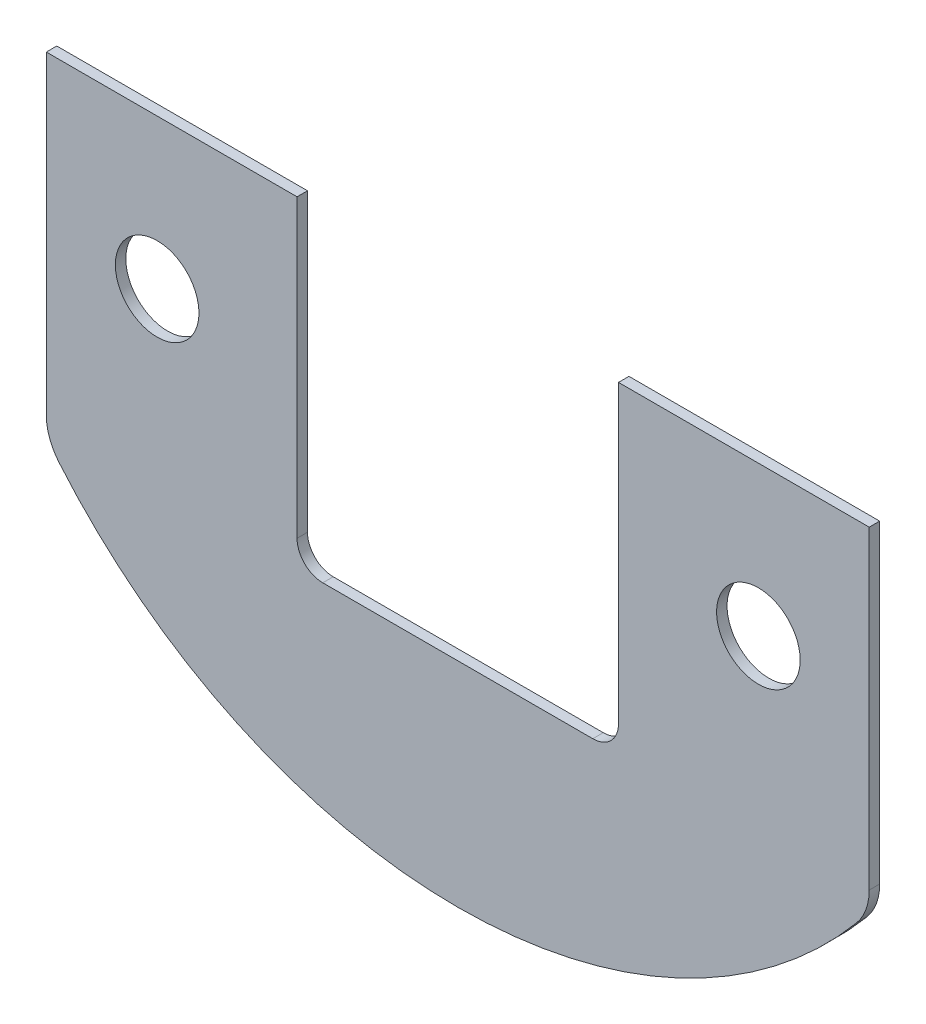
ISO-10303-21;
HEADER;
FILE_DESCRIPTION(('STEP AP214'),'2;1');
FILE_NAME('part.step','',(''),(''),'','','');
FILE_SCHEMA(('AUTOMOTIVE_DESIGN { 1 0 10303 214 1 1 1 1 }'));
ENDSEC;
DATA;
#1=APPLICATION_CONTEXT('core data for automotive mechanical design processes');
#2=APPLICATION_PROTOCOL_DEFINITION('international standard','automotive_design',2000,#1);
#3=PRODUCT_CONTEXT('',#1,'mechanical');
#4=PRODUCT('Part','Part','',(#3));
#5=PRODUCT_RELATED_PRODUCT_CATEGORY('part','',(#4));
#6=PRODUCT_DEFINITION_FORMATION('','',#4);
#7=PRODUCT_DEFINITION_CONTEXT('part definition',#1,'design');
#8=PRODUCT_DEFINITION('design','',#6,#7);
#9=PRODUCT_DEFINITION_SHAPE('','',#8);
#10=(LENGTH_UNIT() NAMED_UNIT(*) SI_UNIT(.MILLI.,.METRE.));
#11=(NAMED_UNIT(*) PLANE_ANGLE_UNIT() SI_UNIT($,.RADIAN.));
#12=(NAMED_UNIT(*) SI_UNIT($,.STERADIAN.) SOLID_ANGLE_UNIT());
#13=UNCERTAINTY_MEASURE_WITH_UNIT(LENGTH_MEASURE(1.E-05),#10,'distance_accuracy_value','');
#14=(GEOMETRIC_REPRESENTATION_CONTEXT(3) GLOBAL_UNCERTAINTY_ASSIGNED_CONTEXT((#13)) GLOBAL_UNIT_ASSIGNED_CONTEXT((#10,
#11,#12)) REPRESENTATION_CONTEXT('',''));
#15=CARTESIAN_POINT('',(0.,0.,0.));
#16=DIRECTION('',(0.,0.,1.));
#17=DIRECTION('',(1.,0.,0.));
#18=AXIS2_PLACEMENT_3D('',#15,#16,#17);
#19=CARTESIAN_POINT('',(-12.5,-25.,0.8128));
#20=DIRECTION('',(-1.,0.,0.));
#21=DIRECTION('',(0.,-1.,0.));
#22=AXIS2_PLACEMENT_3D('',#19,#20,#21);
#23=PLANE('',#22);
#24=DIRECTION('',(0.,1.,0.));
#25=VECTOR('',#24,1.);
#26=CARTESIAN_POINT('',(-12.5,-25.,0.8128));
#27=LINE('',#26,#25);
#28=CARTESIAN_POINT('',(-12.5,-23.,0.8128));
#29=VERTEX_POINT('',#28);
#30=CARTESIAN_POINT('',(-12.5,0.,0.8128));
#31=VERTEX_POINT('',#30);
#32=EDGE_CURVE('E121',#29,#31,#27,.T.);
#33=ORIENTED_EDGE('',*,*,#32,.F.);
#34=DIRECTION('',(0.,0.,-1.));
#35=VECTOR('',#34,1.);
#36=CARTESIAN_POINT('',(-12.5,-23.,0.));
#37=LINE('',#36,#35);
#38=CARTESIAN_POINT('',(-12.5,-23.,0.));
#39=VERTEX_POINT('',#38);
#40=EDGE_CURVE('E154',#29,#39,#37,.T.);
#41=ORIENTED_EDGE('',*,*,#40,.T.);
#42=DIRECTION('',(0.,1.,0.));
#43=VECTOR('',#42,1.);
#44=CARTESIAN_POINT('',(-12.5,-25.,0.));
#45=LINE('',#44,#43);
#46=CARTESIAN_POINT('',(-12.5,0.,0.));
#47=VERTEX_POINT('',#46);
#48=EDGE_CURVE('E140',#39,#47,#45,.T.);
#49=ORIENTED_EDGE('',*,*,#48,.T.);
#50=DIRECTION('',(0.,0.,-1.));
#51=VECTOR('',#50,1.);
#52=CARTESIAN_POINT('',(-12.5,0.,0.8128));
#53=LINE('',#52,#51);
#54=EDGE_CURVE('E133',#31,#47,#53,.T.);
#55=ORIENTED_EDGE('',*,*,#54,.F.);
#56=EDGE_LOOP('',(#33,#41,#49,#55));
#57=FACE_BOUND('',#56,.T.);
#58=ADVANCED_FACE('F36',(#57),#23,.F.);
#59=CARTESIAN_POINT('',(-12.5,0.,0.8128));
#60=DIRECTION('',(0.,-1.,0.));
#61=DIRECTION('',(1.,0.,0.));
#62=AXIS2_PLACEMENT_3D('',#59,#60,#61);
#63=PLANE('',#62);
#64=DIRECTION('',(-1.,0.,0.));
#65=VECTOR('',#64,1.);
#66=CARTESIAN_POINT('',(-12.5,0.,0.));
#67=LINE('',#66,#65);
#68=CARTESIAN_POINT('',(-32.,0.,0.));
#69=VERTEX_POINT('',#68);
#70=EDGE_CURVE('E261',#47,#69,#67,.T.);
#71=ORIENTED_EDGE('',*,*,#70,.T.);
#72=DIRECTION('',(0.,0.,-1.));
#73=VECTOR('',#72,1.);
#74=CARTESIAN_POINT('',(-32.,0.,0.8128));
#75=LINE('',#74,#73);
#76=CARTESIAN_POINT('',(-32.,0.,0.8128));
#77=VERTEX_POINT('',#76);
#78=EDGE_CURVE('E135',#77,#69,#75,.T.);
#79=ORIENTED_EDGE('',*,*,#78,.F.);
#80=DIRECTION('',(-1.,0.,0.));
#81=VECTOR('',#80,1.);
#82=CARTESIAN_POINT('',(-12.5,0.,0.8128));
#83=LINE('',#82,#81);
#84=EDGE_CURVE('E124',#31,#77,#83,.T.);
#85=ORIENTED_EDGE('',*,*,#84,.F.);
#86=ORIENTED_EDGE('',*,*,#54,.T.);
#87=EDGE_LOOP('',(#71,#79,#85,#86));
#88=FACE_BOUND('',#87,.T.);
#89=ADVANCED_FACE('F132',(#88),#63,.F.);
#90=CARTESIAN_POINT('',(-32.,0.,0.8128));
#91=DIRECTION('',(1.,0.,0.));
#92=DIRECTION('',(0.,1.,0.));
#93=AXIS2_PLACEMENT_3D('',#90,#91,#92);
#94=PLANE('',#93);
#95=DIRECTION('',(0.,-1.,0.));
#96=VECTOR('',#95,1.);
#97=CARTESIAN_POINT('',(-32.,0.,0.));
#98=LINE('',#97,#96);
#99=CARTESIAN_POINT('',(-32.,-24.4463,0.));
#100=VERTEX_POINT('',#99);
#101=EDGE_CURVE('E263',#69,#100,#98,.T.);
#102=ORIENTED_EDGE('',*,*,#101,.T.);
#103=DIRECTION('',(0.,0.,-1.));
#104=VECTOR('',#103,1.);
#105=CARTESIAN_POINT('',(-32.,-24.4463,0.8128));
#106=LINE('',#105,#104);
#107=CARTESIAN_POINT('',(-32.,-24.4463,0.8128));
#108=VERTEX_POINT('',#107);
#109=EDGE_CURVE('E146',#108,#100,#106,.T.);
#110=ORIENTED_EDGE('',*,*,#109,.F.);
#111=DIRECTION('',(0.,-1.,0.));
#112=VECTOR('',#111,1.);
#113=CARTESIAN_POINT('',(-32.,0.,0.8128));
#114=LINE('',#113,#112);
#115=EDGE_CURVE('E137',#77,#108,#114,.T.);
#116=ORIENTED_EDGE('',*,*,#115,.F.);
#117=ORIENTED_EDGE('',*,*,#78,.T.);
#118=EDGE_LOOP('',(#102,#110,#116,#117));
#119=FACE_BOUND('',#118,.T.);
#120=ADVANCED_FACE('F185',(#119),#94,.F.);
#121=CARTESIAN_POINT('',(-27.8007628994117,-24.4463,0.8128));
#122=DIRECTION('',(0.,0.,-1.));
#123=DIRECTION('',(-1.,0.,0.));
#124=AXIS2_PLACEMENT_3D('',#121,#122,#123);
#125=CYLINDRICAL_SURFACE('',#124,4.19923710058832);
#126=CARTESIAN_POINT('',(-27.8007628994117,-24.4463,0.));
#127=DIRECTION('',(0.,0.,1.));
#128=DIRECTION('',(1.,0.,0.));
#129=AXIS2_PLACEMENT_3D('',#126,#127,#128);
#130=CIRCLE('',#129,4.19923710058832);
#131=CARTESIAN_POINT('',(-31.0167282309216,-27.1465146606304,0.));
#132=VERTEX_POINT('',#131);
#133=EDGE_CURVE('E265',#100,#132,#130,.T.);
#134=ORIENTED_EDGE('',*,*,#133,.T.);
#135=DIRECTION('',(0.,0.,-1.));
#136=VECTOR('',#135,1.);
#137=CARTESIAN_POINT('',(-31.0167282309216,-27.1465146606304,0.8128));
#138=LINE('',#137,#136);
#139=CARTESIAN_POINT('',(-31.0167282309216,-27.1465146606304,0.8128));
#140=VERTEX_POINT('',#139);
#141=EDGE_CURVE('E288',#140,#132,#138,.T.);
#142=ORIENTED_EDGE('',*,*,#141,.F.);
#143=CARTESIAN_POINT('',(-27.8007628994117,-24.4463,0.8128));
#144=DIRECTION('',(0.,0.,1.));
#145=DIRECTION('',(1.,0.,0.));
#146=AXIS2_PLACEMENT_3D('',#143,#144,#145);
#147=CIRCLE('',#146,4.19923710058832);
#148=EDGE_CURVE('E244',#108,#140,#147,.T.);
#149=ORIENTED_EDGE('',*,*,#148,.F.);
#150=ORIENTED_EDGE('',*,*,#109,.T.);
#151=EDGE_LOOP('',(#134,#142,#149,#150));
#152=FACE_BOUND('',#151,.T.);
#153=ADVANCED_FACE('F190',(#152),#125,.T.);
#154=CARTESIAN_POINT('',(0.,-1.104,0.8128));
#155=DIRECTION('',(0.,0.,-1.));
#156=DIRECTION('',(-1.,0.,0.));
#157=AXIS2_PLACEMENT_3D('',#154,#155,#156);
#158=CYLINDRICAL_SURFACE('',#157,40.5);
#159=CARTESIAN_POINT('',(0.,-1.104,0.));
#160=DIRECTION('',(0.,0.,1.));
#161=DIRECTION('',(1.,0.,0.));
#162=AXIS2_PLACEMENT_3D('',#159,#160,#161);
#163=CIRCLE('',#162,40.5);
#164=CARTESIAN_POINT('',(31.0167282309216,-27.1465146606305,0.));
#165=VERTEX_POINT('',#164);
#166=EDGE_CURVE('E267',#132,#165,#163,.T.);
#167=ORIENTED_EDGE('',*,*,#166,.T.);
#168=DIRECTION('',(0.,0.,-1.));
#169=VECTOR('',#168,1.);
#170=CARTESIAN_POINT('',(31.0167282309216,-27.1465146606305,0.8128));
#171=LINE('',#170,#169);
#172=CARTESIAN_POINT('',(31.0167282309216,-27.1465146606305,0.8128));
#173=VERTEX_POINT('',#172);
#174=EDGE_CURVE('E285',#173,#165,#171,.T.);
#175=ORIENTED_EDGE('',*,*,#174,.F.);
#176=CARTESIAN_POINT('',(0.,-1.104,0.8128));
#177=DIRECTION('',(0.,0.,1.));
#178=DIRECTION('',(1.,0.,0.));
#179=AXIS2_PLACEMENT_3D('',#176,#177,#178);
#180=CIRCLE('',#179,40.5);
#181=EDGE_CURVE('E246',#140,#173,#180,.T.);
#182=ORIENTED_EDGE('',*,*,#181,.F.);
#183=ORIENTED_EDGE('',*,*,#141,.T.);
#184=EDGE_LOOP('',(#167,#175,#182,#183));
#185=FACE_BOUND('',#184,.T.);
#186=ADVANCED_FACE('F194',(#185),#158,.T.);
#187=CARTESIAN_POINT('',(27.8007628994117,-24.4463,0.8128));
#188=DIRECTION('',(0.,0.,-1.));
#189=DIRECTION('',(-1.,0.,0.));
#190=AXIS2_PLACEMENT_3D('',#187,#188,#189);
#191=CYLINDRICAL_SURFACE('',#190,4.19923710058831);
#192=CARTESIAN_POINT('',(27.8007628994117,-24.4463,0.));
#193=DIRECTION('',(0.,0.,1.));
#194=DIRECTION('',(1.,0.,0.));
#195=AXIS2_PLACEMENT_3D('',#192,#193,#194);
#196=CIRCLE('',#195,4.19923710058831);
#197=CARTESIAN_POINT('',(32.,-24.4463,0.));
#198=VERTEX_POINT('',#197);
#199=EDGE_CURVE('E269',#165,#198,#196,.T.);
#200=ORIENTED_EDGE('',*,*,#199,.T.);
#201=DIRECTION('',(0.,0.,-1.));
#202=VECTOR('',#201,1.);
#203=CARTESIAN_POINT('',(32.,-24.4463,0.8128));
#204=LINE('',#203,#202);
#205=CARTESIAN_POINT('',(32.,-24.4463,0.8128));
#206=VERTEX_POINT('',#205);
#207=EDGE_CURVE('E282',#206,#198,#204,.T.);
#208=ORIENTED_EDGE('',*,*,#207,.F.);
#209=CARTESIAN_POINT('',(27.8007628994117,-24.4463,0.8128));
#210=DIRECTION('',(0.,0.,1.));
#211=DIRECTION('',(1.,0.,0.));
#212=AXIS2_PLACEMENT_3D('',#209,#210,#211);
#213=CIRCLE('',#212,4.19923710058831);
#214=EDGE_CURVE('E248',#173,#206,#213,.T.);
#215=ORIENTED_EDGE('',*,*,#214,.F.);
#216=ORIENTED_EDGE('',*,*,#174,.T.);
#217=EDGE_LOOP('',(#200,#208,#215,#216));
#218=FACE_BOUND('',#217,.T.);
#219=ADVANCED_FACE('F198',(#218),#191,.T.);
#220=CARTESIAN_POINT('',(32.,-24.4463,0.8128));
#221=DIRECTION('',(-1.,0.,0.));
#222=DIRECTION('',(0.,0.,1.));
#223=AXIS2_PLACEMENT_3D('',#220,#221,#222);
#224=PLANE('',#223);
#225=DIRECTION('',(0.,1.,0.));
#226=VECTOR('',#225,1.);
#227=CARTESIAN_POINT('',(32.,-24.4463,0.));
#228=LINE('',#227,#226);
#229=CARTESIAN_POINT('',(32.,0.,0.));
#230=VERTEX_POINT('',#229);
#231=EDGE_CURVE('E271',#198,#230,#228,.T.);
#232=ORIENTED_EDGE('',*,*,#231,.T.);
#233=DIRECTION('',(0.,0.,-1.));
#234=VECTOR('',#233,1.);
#235=CARTESIAN_POINT('',(32.,0.,0.8128));
#236=LINE('',#235,#234);
#237=CARTESIAN_POINT('',(32.,0.,0.8128));
#238=VERTEX_POINT('',#237);
#239=EDGE_CURVE('E279',#238,#230,#236,.T.);
#240=ORIENTED_EDGE('',*,*,#239,.F.);
#241=DIRECTION('',(0.,1.,0.));
#242=VECTOR('',#241,1.);
#243=CARTESIAN_POINT('',(32.,-24.4463,0.8128));
#244=LINE('',#243,#242);
#245=EDGE_CURVE('E250',#206,#238,#244,.T.);
#246=ORIENTED_EDGE('',*,*,#245,.F.);
#247=ORIENTED_EDGE('',*,*,#207,.T.);
#248=EDGE_LOOP('',(#232,#240,#246,#247));
#249=FACE_BOUND('',#248,.T.);
#250=ADVANCED_FACE('F202',(#249),#224,.F.);
#251=CARTESIAN_POINT('',(32.,0.,0.8128));
#252=DIRECTION('',(0.,-1.,0.));
#253=DIRECTION('',(1.,0.,0.));
#254=AXIS2_PLACEMENT_3D('',#251,#252,#253);
#255=PLANE('',#254);
#256=DIRECTION('',(-1.,0.,0.));
#257=VECTOR('',#256,1.);
#258=CARTESIAN_POINT('',(32.,0.,0.));
#259=LINE('',#258,#257);
#260=CARTESIAN_POINT('',(12.5,0.,0.));
#261=VERTEX_POINT('',#260);
#262=EDGE_CURVE('E273',#230,#261,#259,.T.);
#263=ORIENTED_EDGE('',*,*,#262,.T.);
#264=DIRECTION('',(0.,0.,-1.));
#265=VECTOR('',#264,1.);
#266=CARTESIAN_POINT('',(12.5,0.,0.8128));
#267=LINE('',#266,#265);
#268=CARTESIAN_POINT('',(12.5,0.,0.8128));
#269=VERTEX_POINT('',#268);
#270=EDGE_CURVE('E259',#269,#261,#267,.T.);
#271=ORIENTED_EDGE('',*,*,#270,.F.);
#272=DIRECTION('',(-1.,0.,0.));
#273=VECTOR('',#272,1.);
#274=CARTESIAN_POINT('',(32.,0.,0.8128));
#275=LINE('',#274,#273);
#276=EDGE_CURVE('E252',#238,#269,#275,.T.);
#277=ORIENTED_EDGE('',*,*,#276,.F.);
#278=ORIENTED_EDGE('',*,*,#239,.T.);
#279=EDGE_LOOP('',(#263,#271,#277,#278));
#280=FACE_BOUND('',#279,.T.);
#281=ADVANCED_FACE('F206',(#280),#255,.F.);
#282=CARTESIAN_POINT('',(12.5,0.,0.8128));
#283=DIRECTION('',(1.,0.,0.));
#284=DIRECTION('',(0.,1.,0.));
#285=AXIS2_PLACEMENT_3D('',#282,#283,#284);
#286=PLANE('',#285);
#287=DIRECTION('',(0.,-1.,0.));
#288=VECTOR('',#287,1.);
#289=CARTESIAN_POINT('',(12.5,0.,0.));
#290=LINE('',#289,#288);
#291=CARTESIAN_POINT('',(12.5,-23.,0.));
#292=VERTEX_POINT('',#291);
#293=EDGE_CURVE('E167',#261,#292,#290,.T.);
#294=ORIENTED_EDGE('',*,*,#293,.T.);
#295=DIRECTION('',(0.,0.,-1.));
#296=VECTOR('',#295,1.);
#297=CARTESIAN_POINT('',(12.5,-23.,0.8128));
#298=LINE('',#297,#296);
#299=CARTESIAN_POINT('',(12.5,-23.,0.8128));
#300=VERTEX_POINT('',#299);
#301=EDGE_CURVE('E152',#292,#300,#298,.F.);
#302=ORIENTED_EDGE('',*,*,#301,.T.);
#303=DIRECTION('',(0.,-1.,0.));
#304=VECTOR('',#303,1.);
#305=CARTESIAN_POINT('',(12.5,0.,0.8128));
#306=LINE('',#305,#304);
#307=EDGE_CURVE('E254',#269,#300,#306,.T.);
#308=ORIENTED_EDGE('',*,*,#307,.F.);
#309=ORIENTED_EDGE('',*,*,#270,.T.);
#310=EDGE_LOOP('',(#294,#302,#308,#309));
#311=FACE_BOUND('',#310,.T.);
#312=ADVANCED_FACE('F210',(#311),#286,.F.);
#313=CARTESIAN_POINT('',(12.5,-25.,0.8128));
#314=DIRECTION('',(0.,-1.,0.));
#315=DIRECTION('',(1.,0.,0.));
#316=AXIS2_PLACEMENT_3D('',#313,#314,#315);
#317=PLANE('',#316);
#318=DIRECTION('',(-1.,0.,0.));
#319=VECTOR('',#318,1.);
#320=CARTESIAN_POINT('',(12.5,-25.,0.8128));
#321=LINE('',#320,#319);
#322=CARTESIAN_POINT('',(10.5,-25.,0.8128));
#323=VERTEX_POINT('',#322);
#324=CARTESIAN_POINT('',(-10.5,-25.,0.8128));
#325=VERTEX_POINT('',#324);
#326=EDGE_CURVE('E257',#323,#325,#321,.T.);
#327=ORIENTED_EDGE('',*,*,#326,.F.);
#328=DIRECTION('',(0.,0.,-1.));
#329=VECTOR('',#328,1.);
#330=CARTESIAN_POINT('',(10.5,-25.,0.));
#331=LINE('',#330,#329);
#332=CARTESIAN_POINT('',(10.5,-25.,0.));
#333=VERTEX_POINT('',#332);
#334=EDGE_CURVE('E144',#323,#333,#331,.T.);
#335=ORIENTED_EDGE('',*,*,#334,.T.);
#336=DIRECTION('',(-1.,0.,0.));
#337=VECTOR('',#336,1.);
#338=CARTESIAN_POINT('',(12.5,-25.,0.));
#339=LINE('',#338,#337);
#340=CARTESIAN_POINT('',(-10.5,-25.,0.));
#341=VERTEX_POINT('',#340);
#342=EDGE_CURVE('E128',#333,#341,#339,.T.);
#343=ORIENTED_EDGE('',*,*,#342,.T.);
#344=DIRECTION('',(0.,0.,-1.));
#345=VECTOR('',#344,1.);
#346=CARTESIAN_POINT('',(-10.5,-25.,0.8128));
#347=LINE('',#346,#345);
#348=EDGE_CURVE('E142',#341,#325,#347,.F.);
#349=ORIENTED_EDGE('',*,*,#348,.T.);
#350=EDGE_LOOP('',(#327,#335,#343,#349));
#351=FACE_BOUND('',#350,.T.);
#352=ADVANCED_FACE('F165',(#351),#317,.F.);
#353=CARTESIAN_POINT('',(-27.8007628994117,-24.4463,0.8128));
#354=DIRECTION('',(0.,0.,1.));
#355=DIRECTION('',(1.,0.,0.));
#356=AXIS2_PLACEMENT_3D('',#353,#354,#355);
#357=PLANE('',#356);
#358=CARTESIAN_POINT('',(23.3811190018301,-11.6429999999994,0.8128));
#359=DIRECTION('',(0.,0.,1.));
#360=DIRECTION('',(1.,0.,0.));
#361=AXIS2_PLACEMENT_3D('',#358,#359,#360);
#362=CIRCLE('',#361,3.25);
#363=CARTESIAN_POINT('',(26.6311190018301,-11.6429999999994,0.8128));
#364=VERTEX_POINT('',#363);
#365=EDGE_CURVE('E233',#364,#364,#362,.T.);
#366=ORIENTED_EDGE('',*,*,#365,.F.);
#367=EDGE_LOOP('',(#366));
#368=FACE_BOUND('',#367,.T.);
#369=CARTESIAN_POINT('',(-23.3811190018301,-11.6429999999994,0.8128));
#370=DIRECTION('',(0.,0.,1.));
#371=DIRECTION('',(-1.,0.,0.));
#372=AXIS2_PLACEMENT_3D('',#369,#370,#371);
#373=CIRCLE('',#372,3.25);
#374=CARTESIAN_POINT('',(-26.6311190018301,-11.6429999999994,0.8128));
#375=VERTEX_POINT('',#374);
#376=EDGE_CURVE('E235',#375,#375,#373,.T.);
#377=ORIENTED_EDGE('',*,*,#376,.F.);
#378=EDGE_LOOP('',(#377));
#379=FACE_BOUND('',#378,.T.);
#380=ORIENTED_EDGE('',*,*,#326,.T.);
#381=CARTESIAN_POINT('',(-10.5,-23.,0.8128));
#382=DIRECTION('',(0.,0.,1.));
#383=DIRECTION('',(1.,0.,0.));
#384=AXIS2_PLACEMENT_3D('',#381,#382,#383);
#385=CIRCLE('',#384,2.);
#386=EDGE_CURVE('E11',#325,#29,#385,.F.);
#387=ORIENTED_EDGE('',*,*,#386,.T.);
#388=ORIENTED_EDGE('',*,*,#32,.T.);
#389=ORIENTED_EDGE('',*,*,#84,.T.);
#390=ORIENTED_EDGE('',*,*,#115,.T.);
#391=ORIENTED_EDGE('',*,*,#148,.T.);
#392=ORIENTED_EDGE('',*,*,#181,.T.);
#393=ORIENTED_EDGE('',*,*,#214,.T.);
#394=ORIENTED_EDGE('',*,*,#245,.T.);
#395=ORIENTED_EDGE('',*,*,#276,.T.);
#396=ORIENTED_EDGE('',*,*,#307,.T.);
#397=CARTESIAN_POINT('',(10.5,-23.,0.8128));
#398=DIRECTION('',(0.,0.,1.));
#399=DIRECTION('',(1.,0.,0.));
#400=AXIS2_PLACEMENT_3D('',#397,#398,#399);
#401=CIRCLE('',#400,2.);
#402=EDGE_CURVE('E158',#300,#323,#401,.F.);
#403=ORIENTED_EDGE('',*,*,#402,.T.);
#404=EDGE_LOOP('',(#380,#387,#388,#389,#390,#391,#392,#393,#394,#395,#396,#403));
#405=FACE_BOUND('',#404,.T.);
#406=ADVANCED_FACE('F123',(#368,#379,#405),#357,.T.);
#407=CARTESIAN_POINT('',(-27.8007628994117,-24.4463,0.));
#408=DIRECTION('',(0.,0.,1.));
#409=DIRECTION('',(1.,0.,0.));
#410=AXIS2_PLACEMENT_3D('',#407,#408,#409);
#411=PLANE('',#410);
#412=CARTESIAN_POINT('',(23.3811190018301,-11.6429999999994,0.));
#413=DIRECTION('',(0.,0.,1.));
#414=DIRECTION('',(1.,0.,0.));
#415=AXIS2_PLACEMENT_3D('',#412,#413,#414);
#416=CIRCLE('',#415,3.25);
#417=CARTESIAN_POINT('',(26.6311190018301,-11.6429999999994,0.));
#418=VERTEX_POINT('',#417);
#419=EDGE_CURVE('E230',#418,#418,#416,.T.);
#420=ORIENTED_EDGE('',*,*,#419,.T.);
#421=EDGE_LOOP('',(#420));
#422=FACE_BOUND('',#421,.T.);
#423=CARTESIAN_POINT('',(-23.3811190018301,-11.6429999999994,0.));
#424=DIRECTION('',(0.,0.,1.));
#425=DIRECTION('',(-1.,0.,0.));
#426=AXIS2_PLACEMENT_3D('',#423,#424,#425);
#427=CIRCLE('',#426,3.25);
#428=CARTESIAN_POINT('',(-26.6311190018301,-11.6429999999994,0.));
#429=VERTEX_POINT('',#428);
#430=EDGE_CURVE('E238',#429,#429,#427,.T.);
#431=ORIENTED_EDGE('',*,*,#430,.T.);
#432=EDGE_LOOP('',(#431));
#433=FACE_BOUND('',#432,.T.);
#434=ORIENTED_EDGE('',*,*,#48,.F.);
#435=CARTESIAN_POINT('',(-10.5,-23.,0.));
#436=DIRECTION('',(0.,0.,1.));
#437=DIRECTION('',(1.,0.,0.));
#438=AXIS2_PLACEMENT_3D('',#435,#436,#437);
#439=CIRCLE('',#438,2.);
#440=EDGE_CURVE('E44',#39,#341,#439,.T.);
#441=ORIENTED_EDGE('',*,*,#440,.T.);
#442=ORIENTED_EDGE('',*,*,#342,.F.);
#443=CARTESIAN_POINT('',(10.5,-23.,0.));
#444=DIRECTION('',(0.,0.,1.));
#445=DIRECTION('',(1.,0.,0.));
#446=AXIS2_PLACEMENT_3D('',#443,#444,#445);
#447=CIRCLE('',#446,2.);
#448=EDGE_CURVE('E156',#333,#292,#447,.T.);
#449=ORIENTED_EDGE('',*,*,#448,.T.);
#450=ORIENTED_EDGE('',*,*,#293,.F.);
#451=ORIENTED_EDGE('',*,*,#262,.F.);
#452=ORIENTED_EDGE('',*,*,#231,.F.);
#453=ORIENTED_EDGE('',*,*,#199,.F.);
#454=ORIENTED_EDGE('',*,*,#166,.F.);
#455=ORIENTED_EDGE('',*,*,#133,.F.);
#456=ORIENTED_EDGE('',*,*,#101,.F.);
#457=ORIENTED_EDGE('',*,*,#70,.F.);
#458=EDGE_LOOP('',(#434,#441,#442,#449,#450,#451,#452,#453,#454,#455,#456,#457));
#459=FACE_BOUND('',#458,.T.);
#460=ADVANCED_FACE('F162',(#422,#433,#459),#411,.F.);
#461=CARTESIAN_POINT('',(10.5,-23.,0.8128));
#462=DIRECTION('',(0.,0.,1.));
#463=DIRECTION('',(1.,0.,0.));
#464=AXIS2_PLACEMENT_3D('',#461,#462,#463);
#465=CYLINDRICAL_SURFACE('',#464,2.);
#466=ORIENTED_EDGE('',*,*,#402,.F.);
#467=ORIENTED_EDGE('',*,*,#301,.F.);
#468=ORIENTED_EDGE('',*,*,#448,.F.);
#469=ORIENTED_EDGE('',*,*,#334,.F.);
#470=EDGE_LOOP('',(#466,#467,#468,#469));
#471=FACE_BOUND('',#470,.T.);
#472=ADVANCED_FACE('F171',(#471),#465,.F.);
#473=CARTESIAN_POINT('',(-10.5,-23.,0.8128));
#474=DIRECTION('',(0.,0.,1.));
#475=DIRECTION('',(1.,0.,0.));
#476=AXIS2_PLACEMENT_3D('',#473,#474,#475);
#477=CYLINDRICAL_SURFACE('',#476,2.);
#478=ORIENTED_EDGE('',*,*,#386,.F.);
#479=ORIENTED_EDGE('',*,*,#348,.F.);
#480=ORIENTED_EDGE('',*,*,#440,.F.);
#481=ORIENTED_EDGE('',*,*,#40,.F.);
#482=EDGE_LOOP('',(#478,#479,#480,#481));
#483=FACE_BOUND('',#482,.T.);
#484=ADVANCED_FACE('F38',(#483),#477,.F.);
#485=CARTESIAN_POINT('',(-23.3811190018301,-11.6429999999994,0.));
#486=DIRECTION('',(0.,0.,1.));
#487=DIRECTION('',(1.,0.,0.));
#488=AXIS2_PLACEMENT_3D('',#485,#486,#487);
#489=CYLINDRICAL_SURFACE('',#488,3.25);
#490=ORIENTED_EDGE('',*,*,#430,.F.);
#491=EDGE_LOOP('',(#490));
#492=FACE_BOUND('',#491,.T.);
#493=ORIENTED_EDGE('',*,*,#376,.T.);
#494=EDGE_LOOP('',(#493));
#495=FACE_BOUND('',#494,.T.);
#496=ADVANCED_FACE('F170',(#492,#495),#489,.F.);
#497=CARTESIAN_POINT('',(23.3811190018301,-11.6429999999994,0.));
#498=DIRECTION('',(0.,0.,1.));
#499=DIRECTION('',(1.,0.,0.));
#500=AXIS2_PLACEMENT_3D('',#497,#498,#499);
#501=CYLINDRICAL_SURFACE('',#500,3.25);
#502=ORIENTED_EDGE('',*,*,#419,.F.);
#503=EDGE_LOOP('',(#502));
#504=FACE_BOUND('',#503,.T.);
#505=ORIENTED_EDGE('',*,*,#365,.T.);
#506=EDGE_LOOP('',(#505));
#507=FACE_BOUND('',#506,.T.);
#508=ADVANCED_FACE('F176',(#504,#507),#501,.F.);
#509=CLOSED_SHELL('',(#58,#89,#120,#153,#186,#219,#250,#281,#312,#352,#406,#460,#472,#484,#496,#508));
#510=MANIFOLD_SOLID_BREP('B2',#509);
#511=ADVANCED_BREP_SHAPE_REPRESENTATION('',(#18,#510),#14);
#512=SHAPE_DEFINITION_REPRESENTATION(#9,#511);
ENDSEC;
END-ISO-10303-21;
